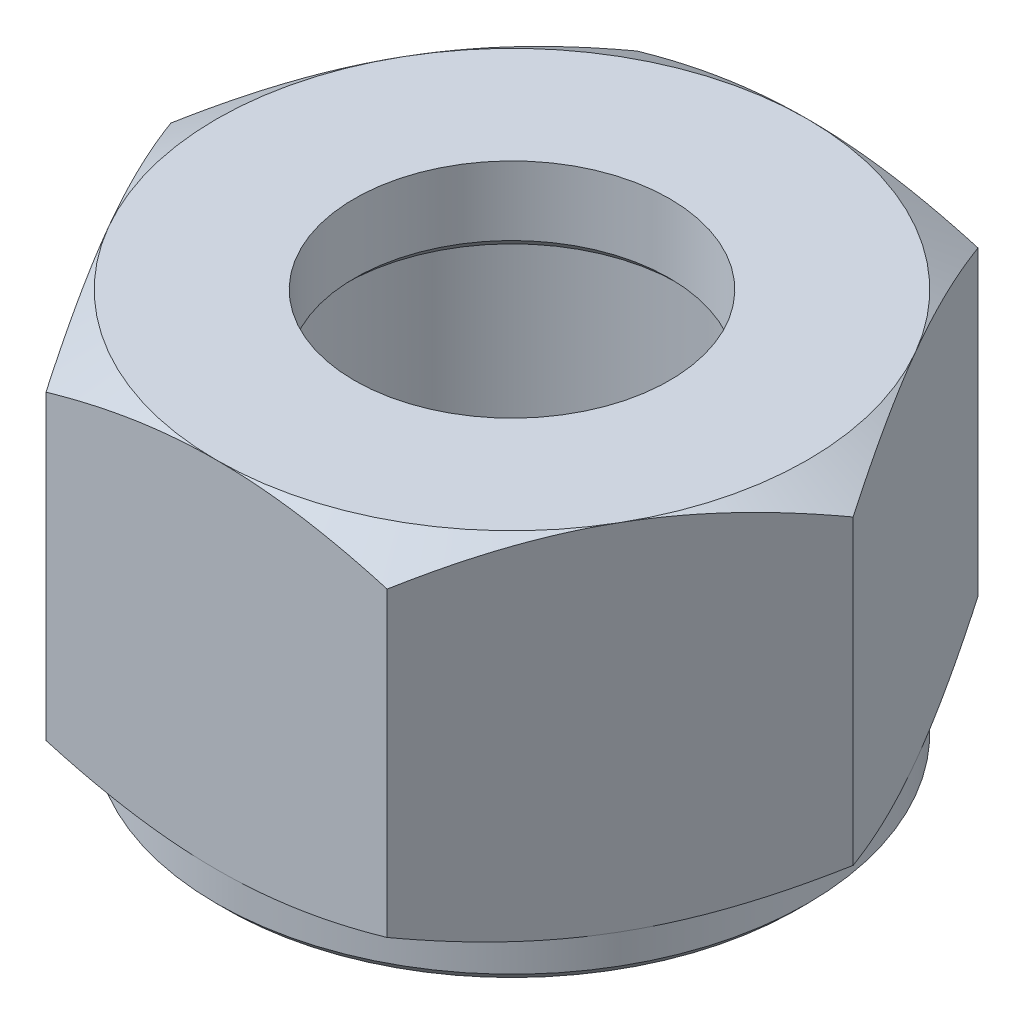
from build123d import *

# Parameters (mm, degrees)
P_IDAT_VYSUNUT_M1_DEPTH  = 18
SKICA2_OUTSIDE_W         = 108.842
SKICA2_OUTSIDE_H         = 104.2
SKICA2_OUTSIDE_R         = 15
ODEBRAT_VYSUNUT_M1_DEPTH = 18
ODEBRAT_VYSUNUT_M1_DRAFT = -60
SKICA3_OUTSIDE_W         = 108.842
SKICA3_OUTSIDE_H         = 104.2
SKICA3_OUTSIDE_R         = 15
ODEBRAT_VYSUNUT_M2_DEPTH = 18
ODEBRAT_VYSUNUT_M2_DRAFT = -60
SKICA4_R                 = 15
P_IDAT_VYSUNUT_M2_DEPTH  = 2
ZKOSEN_1_SIZE            = 0.5
SKICA5_R                 = 11
ODEBRAT_VYSUNUT_M3_DEPTH = 16
ODEBRAT_VYSUNUT_M4_REACH = 32.414
SKICA6_R                 = 8
ZKOSEN_2_SIZE            = 0.5


with BuildPart() as part:
    # Skica1 → P_idat vysunut_m1 (new body)
    with BuildSketch(Plane(origin=(0, 0, 0), x_dir=(1, 0, 0), z_dir=(0, 1, 0))):
        Polygon((17.320508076, 0), (8.660254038, 15), (-8.660254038, 15), (-17.320508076, 0), (-8.660254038, -15), (8.660254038, -15), align=None)
    extrude(amount=P_IDAT_VYSUNUT_M1_DEPTH)


with BuildPart() as odebrat_vysunut_m1_tool:
    # Skica2 outside → Odebrat vysunut_m1 (with draft: the straight prism first)
    with BuildSketch(Plane(origin=(0, 18, 0), x_dir=(-1, 0, 0), z_dir=(0, 1, 0))):
        Rectangle(SKICA2_OUTSIDE_W, SKICA2_OUTSIDE_H)
        Circle(SKICA2_OUTSIDE_R, mode=Mode.SUBTRACT)
    extrude(amount=-ODEBRAT_VYSUNUT_M1_DEPTH)
    # Odebrat vysunut_m1: the draft: its side faces are tilted about the plane it starts from
    odebrat_vysunut_m1_sides = [odebrat_vysunut_m1_tool.faces().sort_by_distance(p)[0] for p in [
        (0, 9, -52.1),
        (-54.421, 9, 0),
        (0, 9, 52.1),
        (54.421, 9, 0),
        (15, 9, 0),
    ]]
    draft(odebrat_vysunut_m1_sides, Plane(origin=(0, 18, 0), x_dir=(-1, 0, 0), z_dir=(0, 1, 0)), ODEBRAT_VYSUNUT_M1_DRAFT)


with BuildPart() as part_1:
    add(part.part)

    # Odebrat vysunut_m1: cut by odebrat_vysunut_m1_tool
    add(odebrat_vysunut_m1_tool.part, mode=Mode.SUBTRACT)


with BuildPart() as odebrat_vysunut_m2_tool:
    # Skica3 outside → Odebrat vysunut_m2 (with draft: the straight prism first)
    with BuildSketch(Plane.XZ):
        Rectangle(SKICA3_OUTSIDE_W, SKICA3_OUTSIDE_H)
        Circle(SKICA3_OUTSIDE_R, mode=Mode.SUBTRACT)
    extrude(amount=-ODEBRAT_VYSUNUT_M2_DEPTH)
    # Odebrat vysunut_m2: the draft: its side faces are tilted about the plane it starts from
    odebrat_vysunut_m2_sides = [odebrat_vysunut_m2_tool.faces().sort_by_distance(p)[0] for p in [
        (0, 9, -52.1),
        (54.421, 9, 0),
        (0, 9, 52.1),
        (-54.421, 9, 0),
        (-15, 9, 0),
    ]]
    draft(odebrat_vysunut_m2_sides, Plane.XZ, ODEBRAT_VYSUNUT_M2_DRAFT)


with BuildPart() as part_2:
    add(part_1.part)

    # Odebrat vysunut_m2: cut by odebrat_vysunut_m2_tool
    add(odebrat_vysunut_m2_tool.part, mode=Mode.SUBTRACT)

    # Skica4 → P_idat vysunut_m2 (add)
    with BuildSketch(Plane.XZ):
        with Locations(Location((0, 0, 0), (0, 0, 270))):
            Circle(SKICA4_R)
    extrude(amount=P_IDAT_VYSUNUT_M2_DEPTH)

    # Zkosen_1
    zkosen_1_edges = [part_2.edges().sort_by_distance(p)[0] for p in [
        (0, -2, 15),
    ]]
    chamfer(zkosen_1_edges, length=ZKOSEN_1_SIZE)

    # Skica5 → Odebrat vysunut_m3 (cut)
    with BuildSketch(Plane.XZ.offset(2)):
        with Locations(Location((0, 0, 0), (0, 0, 270))):
            Circle(SKICA5_R)
    extrude(amount=-ODEBRAT_VYSUNUT_M3_DEPTH, mode=Mode.SUBTRACT)

    # Skica6 → Odebrat vysunut_m4 (cut, up to next)
    with BuildSketch(Plane(origin=(0, 18, 0), x_dir=(1, 0, 0), z_dir=(0, 1, 0)), mode=Mode.PRIVATE) as odebrat_vysunut_m4_sk1:
        with Locations(Location((0, 0, 0), (0, 0, 270))):
            Circle(SKICA6_R)
    odebrat_vysunut_m4_tool1 = extrude(odebrat_vysunut_m4_sk1.sketch, amount=-ODEBRAT_VYSUNUT_M4_REACH, mode=Mode.PRIVATE) & part_2.part
    add(odebrat_vysunut_m4_tool1.solids().sort_by_distance((0, 18, 0))[0], mode=Mode.SUBTRACT)

    # Zkosen_2
    zkosen_2_edges = [part_2.edges().sort_by_distance(p)[0] for p in [
        (0, 14, -8),
    ]]
    chamfer(zkosen_2_edges, length=ZKOSEN_2_SIZE)


solid = part_2.part
